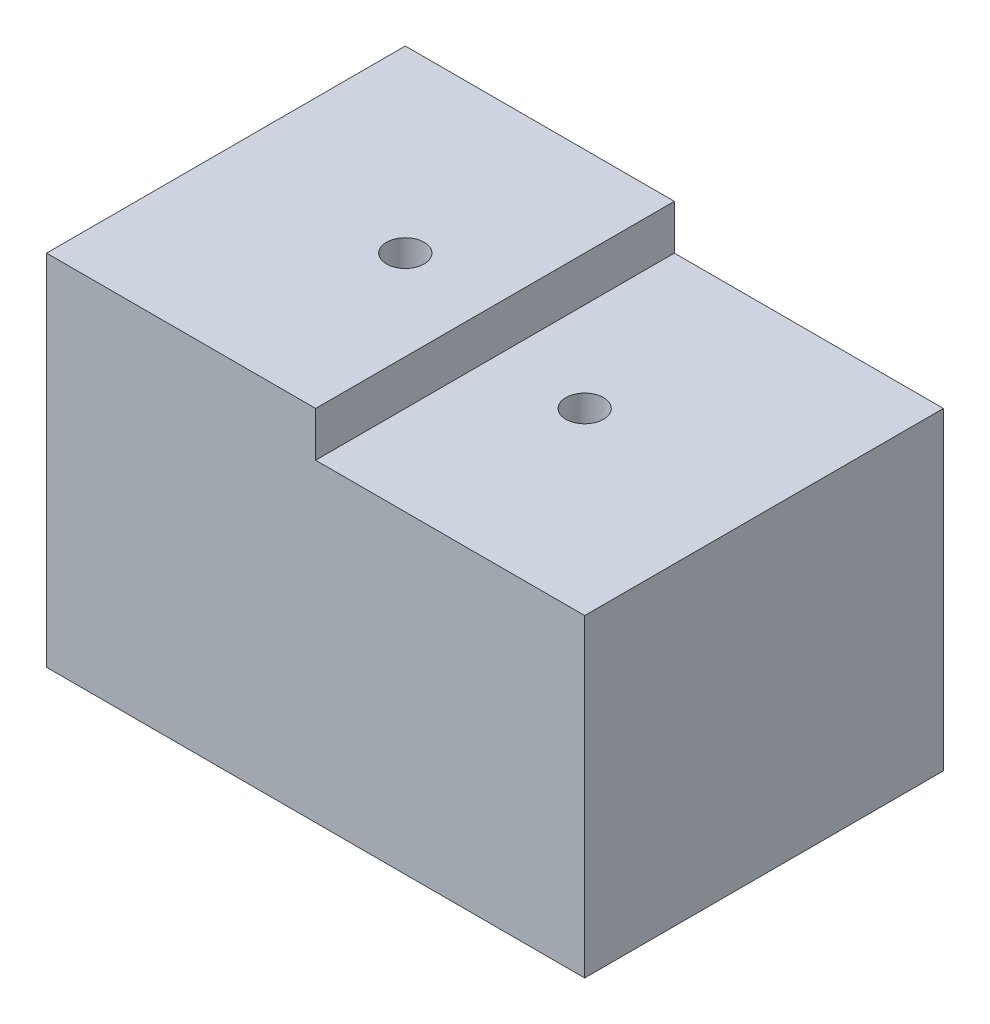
ISO-10303-21;
HEADER;
FILE_DESCRIPTION(('STEP AP214'),'2;1');
FILE_NAME('part.step','',(''),(''),'','','');
FILE_SCHEMA(('AUTOMOTIVE_DESIGN { 1 0 10303 214 1 1 1 1 }'));
ENDSEC;
DATA;
#1=APPLICATION_CONTEXT('core data for automotive mechanical design processes');
#2=APPLICATION_PROTOCOL_DEFINITION('international standard','automotive_design',2000,#1);
#3=PRODUCT_CONTEXT('',#1,'mechanical');
#4=PRODUCT('Part','Part','',(#3));
#5=PRODUCT_RELATED_PRODUCT_CATEGORY('part','',(#4));
#6=PRODUCT_DEFINITION_FORMATION('','',#4);
#7=PRODUCT_DEFINITION_CONTEXT('part definition',#1,'design');
#8=PRODUCT_DEFINITION('design','',#6,#7);
#9=PRODUCT_DEFINITION_SHAPE('','',#8);
#10=(LENGTH_UNIT() NAMED_UNIT(*) SI_UNIT(.MILLI.,.METRE.));
#11=(NAMED_UNIT(*) PLANE_ANGLE_UNIT() SI_UNIT($,.RADIAN.));
#12=(NAMED_UNIT(*) SI_UNIT($,.STERADIAN.) SOLID_ANGLE_UNIT());
#13=UNCERTAINTY_MEASURE_WITH_UNIT(LENGTH_MEASURE(1.E-05),#10,'distance_accuracy_value','');
#14=(GEOMETRIC_REPRESENTATION_CONTEXT(3) GLOBAL_UNCERTAINTY_ASSIGNED_CONTEXT((#13)) GLOBAL_UNIT_ASSIGNED_CONTEXT((#10,
#11,#12)) REPRESENTATION_CONTEXT('',''));
#15=CARTESIAN_POINT('',(0.,0.,0.));
#16=DIRECTION('',(0.,0.,1.));
#17=DIRECTION('',(1.,0.,0.));
#18=AXIS2_PLACEMENT_3D('',#15,#16,#17);
#19=CARTESIAN_POINT('',(60.,40.,0.));
#20=DIRECTION('',(-1.,0.,0.));
#21=DIRECTION('',(0.,0.,1.));
#22=AXIS2_PLACEMENT_3D('',#19,#20,#21);
#23=PLANE('',#22);
#24=DIRECTION('',(0.,0.,-1.));
#25=VECTOR('',#24,1.);
#26=CARTESIAN_POINT('',(60.,35.,-40.));
#27=LINE('',#26,#25);
#28=CARTESIAN_POINT('',(60.,35.,0.));
#29=VERTEX_POINT('',#28);
#30=CARTESIAN_POINT('',(60.,35.,-40.));
#31=VERTEX_POINT('',#30);
#32=EDGE_CURVE('E128',#29,#31,#27,.T.);
#33=ORIENTED_EDGE('',*,*,#32,.F.);
#34=DIRECTION('',(0.,-1.,0.));
#35=VECTOR('',#34,1.);
#36=CARTESIAN_POINT('',(60.,40.,0.));
#37=LINE('',#36,#35);
#38=CARTESIAN_POINT('',(60.,0.,0.));
#39=VERTEX_POINT('',#38);
#40=EDGE_CURVE('E40',#29,#39,#37,.T.);
#41=ORIENTED_EDGE('',*,*,#40,.T.);
#42=DIRECTION('',(0.,0.,-1.));
#43=VECTOR('',#42,1.);
#44=CARTESIAN_POINT('',(60.,0.,0.));
#45=LINE('',#44,#43);
#46=CARTESIAN_POINT('',(60.,0.,-40.));
#47=VERTEX_POINT('',#46);
#48=EDGE_CURVE('E126',#39,#47,#45,.T.);
#49=ORIENTED_EDGE('',*,*,#48,.T.);
#50=DIRECTION('',(0.,-1.,0.));
#51=VECTOR('',#50,1.);
#52=CARTESIAN_POINT('',(60.,40.,-40.));
#53=LINE('',#52,#51);
#54=EDGE_CURVE('E118',#31,#47,#53,.T.);
#55=ORIENTED_EDGE('',*,*,#54,.F.);
#56=EDGE_LOOP('',(#33,#41,#49,#55));
#57=FACE_BOUND('',#56,.T.);
#58=ADVANCED_FACE('F31',(#57),#23,.F.);
#59=CARTESIAN_POINT('',(0.,40.,0.));
#60=DIRECTION('',(1.,0.,0.));
#61=DIRECTION('',(0.,0.,-1.));
#62=AXIS2_PLACEMENT_3D('',#59,#60,#61);
#63=PLANE('',#62);
#64=DIRECTION('',(0.,0.,1.));
#65=VECTOR('',#64,1.);
#66=CARTESIAN_POINT('',(0.,0.,0.));
#67=LINE('',#66,#65);
#68=CARTESIAN_POINT('',(0.,0.,-40.));
#69=VERTEX_POINT('',#68);
#70=CARTESIAN_POINT('',(0.,0.,0.));
#71=VERTEX_POINT('',#70);
#72=EDGE_CURVE('E133',#69,#71,#67,.T.);
#73=ORIENTED_EDGE('',*,*,#72,.T.);
#74=DIRECTION('',(0.,-1.,0.));
#75=VECTOR('',#74,1.);
#76=CARTESIAN_POINT('',(0.,40.,0.));
#77=LINE('',#76,#75);
#78=CARTESIAN_POINT('',(0.,40.,0.));
#79=VERTEX_POINT('',#78);
#80=EDGE_CURVE('E11',#79,#71,#77,.T.);
#81=ORIENTED_EDGE('',*,*,#80,.F.);
#82=DIRECTION('',(0.,0.,1.));
#83=VECTOR('',#82,1.);
#84=CARTESIAN_POINT('',(0.,40.,0.));
#85=LINE('',#84,#83);
#86=CARTESIAN_POINT('',(0.,40.,-40.));
#87=VERTEX_POINT('',#86);
#88=EDGE_CURVE('E107',#87,#79,#85,.T.);
#89=ORIENTED_EDGE('',*,*,#88,.F.);
#90=DIRECTION('',(0.,-1.,0.));
#91=VECTOR('',#90,1.);
#92=CARTESIAN_POINT('',(0.,40.,-40.));
#93=LINE('',#92,#91);
#94=EDGE_CURVE('E110',#87,#69,#93,.T.);
#95=ORIENTED_EDGE('',*,*,#94,.T.);
#96=EDGE_LOOP('',(#73,#81,#89,#95));
#97=FACE_BOUND('',#96,.T.);
#98=ADVANCED_FACE('F33',(#97),#63,.F.);
#99=CARTESIAN_POINT('',(0.,40.,0.));
#100=DIRECTION('',(0.,0.,-1.));
#101=DIRECTION('',(-1.,0.,0.));
#102=AXIS2_PLACEMENT_3D('',#99,#100,#101);
#103=PLANE('',#102);
#104=DIRECTION('',(1.,0.,0.));
#105=VECTOR('',#104,1.);
#106=CARTESIAN_POINT('',(30.,35.,0.));
#107=LINE('',#106,#105);
#108=CARTESIAN_POINT('',(30.,35.,0.));
#109=VERTEX_POINT('',#108);
#110=EDGE_CURVE('E102',#109,#29,#107,.T.);
#111=ORIENTED_EDGE('',*,*,#110,.F.);
#112=DIRECTION('',(0.,1.,0.));
#113=VECTOR('',#112,1.);
#114=CARTESIAN_POINT('',(30.,35.,0.));
#115=LINE('',#114,#113);
#116=CARTESIAN_POINT('',(30.,40.,0.));
#117=VERTEX_POINT('',#116);
#118=EDGE_CURVE('E92',#109,#117,#115,.T.);
#119=ORIENTED_EDGE('',*,*,#118,.T.);
#120=DIRECTION('',(1.,0.,0.));
#121=VECTOR('',#120,1.);
#122=CARTESIAN_POINT('',(0.,40.,0.));
#123=LINE('',#122,#121);
#124=EDGE_CURVE('E100',#79,#117,#123,.T.);
#125=ORIENTED_EDGE('',*,*,#124,.F.);
#126=ORIENTED_EDGE('',*,*,#80,.T.);
#127=DIRECTION('',(1.,0.,0.));
#128=VECTOR('',#127,1.);
#129=CARTESIAN_POINT('',(0.,0.,0.));
#130=LINE('',#129,#128);
#131=EDGE_CURVE('E129',#71,#39,#130,.T.);
#132=ORIENTED_EDGE('',*,*,#131,.T.);
#133=ORIENTED_EDGE('',*,*,#40,.F.);
#134=EDGE_LOOP('',(#111,#119,#125,#126,#132,#133));
#135=FACE_BOUND('',#134,.T.);
#136=ADVANCED_FACE('F99',(#135),#103,.F.);
#137=CARTESIAN_POINT('',(0.,40.,-40.));
#138=DIRECTION('',(0.,0.,1.));
#139=DIRECTION('',(1.,0.,0.));
#140=AXIS2_PLACEMENT_3D('',#137,#138,#139);
#141=PLANE('',#140);
#142=DIRECTION('',(-1.,0.,0.));
#143=VECTOR('',#142,1.);
#144=CARTESIAN_POINT('',(0.,40.,-40.));
#145=LINE('',#144,#143);
#146=CARTESIAN_POINT('',(30.,40.,-40.));
#147=VERTEX_POINT('',#146);
#148=EDGE_CURVE('E54',#147,#87,#145,.T.);
#149=ORIENTED_EDGE('',*,*,#148,.F.);
#150=DIRECTION('',(0.,1.,0.));
#151=VECTOR('',#150,1.);
#152=CARTESIAN_POINT('',(30.,35.,-40.));
#153=LINE('',#152,#151);
#154=CARTESIAN_POINT('',(30.,35.,-40.));
#155=VERTEX_POINT('',#154);
#156=EDGE_CURVE('E47',#155,#147,#153,.T.);
#157=ORIENTED_EDGE('',*,*,#156,.F.);
#158=DIRECTION('',(-1.,0.,0.));
#159=VECTOR('',#158,1.);
#160=CARTESIAN_POINT('',(30.,35.,-40.));
#161=LINE('',#160,#159);
#162=EDGE_CURVE('E103',#31,#155,#161,.T.);
#163=ORIENTED_EDGE('',*,*,#162,.F.);
#164=ORIENTED_EDGE('',*,*,#54,.T.);
#165=DIRECTION('',(-1.,0.,0.));
#166=VECTOR('',#165,1.);
#167=CARTESIAN_POINT('',(0.,0.,-40.));
#168=LINE('',#167,#166);
#169=EDGE_CURVE('E112',#47,#69,#168,.T.);
#170=ORIENTED_EDGE('',*,*,#169,.T.);
#171=ORIENTED_EDGE('',*,*,#94,.F.);
#172=EDGE_LOOP('',(#149,#157,#163,#164,#170,#171));
#173=FACE_BOUND('',#172,.T.);
#174=ADVANCED_FACE('F158',(#173),#141,.F.);
#175=CARTESIAN_POINT('',(0.,40.,-40.));
#176=DIRECTION('',(0.,-1.,0.));
#177=DIRECTION('',(0.,0.,-1.));
#178=AXIS2_PLACEMENT_3D('',#175,#176,#177);
#179=PLANE('',#178);
#180=CARTESIAN_POINT('',(20.,40.,-20.));
#181=DIRECTION('',(0.,1.,0.));
#182=DIRECTION('',(0.,0.,1.));
#183=AXIS2_PLACEMENT_3D('',#180,#181,#182);
#184=CIRCLE('',#183,2.09999999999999);
#185=CARTESIAN_POINT('',(20.,40.,-17.9));
#186=VERTEX_POINT('',#185);
#187=EDGE_CURVE('E142',#186,#186,#184,.T.);
#188=ORIENTED_EDGE('',*,*,#187,.F.);
#189=EDGE_LOOP('',(#188));
#190=FACE_BOUND('',#189,.T.);
#191=ORIENTED_EDGE('',*,*,#124,.T.);
#192=DIRECTION('',(0.,0.,1.));
#193=VECTOR('',#192,1.);
#194=CARTESIAN_POINT('',(30.,40.,-40.));
#195=LINE('',#194,#193);
#196=EDGE_CURVE('E89',#147,#117,#195,.T.);
#197=ORIENTED_EDGE('',*,*,#196,.F.);
#198=ORIENTED_EDGE('',*,*,#148,.T.);
#199=ORIENTED_EDGE('',*,*,#88,.T.);
#200=EDGE_LOOP('',(#191,#197,#198,#199));
#201=FACE_BOUND('',#200,.T.);
#202=ADVANCED_FACE('F105',(#190,#201),#179,.F.);
#203=CARTESIAN_POINT('',(0.,0.,-40.));
#204=DIRECTION('',(0.,-1.,0.));
#205=DIRECTION('',(0.,0.,-1.));
#206=AXIS2_PLACEMENT_3D('',#203,#204,#205);
#207=PLANE('',#206);
#208=ORIENTED_EDGE('',*,*,#72,.F.);
#209=ORIENTED_EDGE('',*,*,#169,.F.);
#210=ORIENTED_EDGE('',*,*,#48,.F.);
#211=ORIENTED_EDGE('',*,*,#131,.F.);
#212=EDGE_LOOP('',(#208,#209,#210,#211));
#213=FACE_BOUND('',#212,.T.);
#214=ADVANCED_FACE('F135',(#213),#207,.T.);
#215=CARTESIAN_POINT('',(20.,40.,-20.));
#216=DIRECTION('',(0.,1.,0.));
#217=DIRECTION('',(0.,0.,1.));
#218=AXIS2_PLACEMENT_3D('',#215,#216,#217);
#219=CYLINDRICAL_SURFACE('',#218,2.09999999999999);
#220=CARTESIAN_POINT('',(20.,20.,-20.));
#221=DIRECTION('',(0.,1.,0.));
#222=DIRECTION('',(0.,0.,1.));
#223=AXIS2_PLACEMENT_3D('',#220,#221,#222);
#224=CIRCLE('',#223,2.09999999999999);
#225=CARTESIAN_POINT('',(20.,20.,-17.9));
#226=VERTEX_POINT('',#225);
#227=EDGE_CURVE('E145',#226,#226,#224,.T.);
#228=ORIENTED_EDGE('',*,*,#227,.F.);
#229=EDGE_LOOP('',(#228));
#230=FACE_BOUND('',#229,.T.);
#231=ORIENTED_EDGE('',*,*,#187,.T.);
#232=EDGE_LOOP('',(#231));
#233=FACE_BOUND('',#232,.T.);
#234=ADVANCED_FACE('F177',(#230,#233),#219,.F.);
#235=CARTESIAN_POINT('',(20.,20.,-20.));
#236=DIRECTION('',(0.,1.,0.));
#237=DIRECTION('',(0.,0.,1.));
#238=AXIS2_PLACEMENT_3D('',#235,#236,#237);
#239=CONICAL_SURFACE('',#238,2.09999999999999,1.02974425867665);
#240=CARTESIAN_POINT('',(20.,18.7381927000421,-20.));
#241=VERTEX_POINT('',#240);
#242=VERTEX_LOOP('',#241);
#243=FACE_BOUND('',#242,.T.);
#244=ORIENTED_EDGE('',*,*,#227,.T.);
#245=EDGE_LOOP('',(#244));
#246=FACE_BOUND('',#245,.T.);
#247=ADVANCED_FACE('F188',(#243,#246),#239,.F.);
#248=CARTESIAN_POINT('',(30.,35.,0.));
#249=DIRECTION('',(0.,1.,0.));
#250=DIRECTION('',(0.,0.,1.));
#251=AXIS2_PLACEMENT_3D('',#248,#249,#250);
#252=PLANE('',#251);
#253=DIRECTION('',(0.,0.,1.));
#254=VECTOR('',#253,1.);
#255=CARTESIAN_POINT('',(30.,35.,-40.));
#256=LINE('',#255,#254);
#257=EDGE_CURVE('E95',#155,#109,#256,.T.);
#258=ORIENTED_EDGE('',*,*,#257,.T.);
#259=ORIENTED_EDGE('',*,*,#110,.T.);
#260=ORIENTED_EDGE('',*,*,#32,.T.);
#261=ORIENTED_EDGE('',*,*,#162,.T.);
#262=EDGE_LOOP('',(#258,#259,#260,#261));
#263=FACE_BOUND('',#262,.T.);
#264=CARTESIAN_POINT('',(40.,35.,-20.));
#265=DIRECTION('',(0.,1.,0.));
#266=DIRECTION('',(0.,0.,1.));
#267=AXIS2_PLACEMENT_3D('',#264,#265,#266);
#268=CIRCLE('',#267,2.09999999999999);
#269=CARTESIAN_POINT('',(40.,35.,-17.9));
#270=VERTEX_POINT('',#269);
#271=EDGE_CURVE('E35',#270,#270,#268,.F.);
#272=ORIENTED_EDGE('',*,*,#271,.T.);
#273=EDGE_LOOP('',(#272));
#274=FACE_BOUND('',#273,.T.);
#275=ADVANCED_FACE('F154',(#263,#274),#252,.T.);
#276=CARTESIAN_POINT('',(30.,35.,-40.));
#277=DIRECTION('',(-1.,0.,0.));
#278=DIRECTION('',(0.,0.,1.));
#279=AXIS2_PLACEMENT_3D('',#276,#277,#278);
#280=PLANE('',#279);
#281=ORIENTED_EDGE('',*,*,#196,.T.);
#282=ORIENTED_EDGE('',*,*,#118,.F.);
#283=ORIENTED_EDGE('',*,*,#257,.F.);
#284=ORIENTED_EDGE('',*,*,#156,.T.);
#285=EDGE_LOOP('',(#281,#282,#283,#284));
#286=FACE_BOUND('',#285,.T.);
#287=ADVANCED_FACE('F91',(#286),#280,.F.);
#288=CARTESIAN_POINT('',(40.,20.,-20.));
#289=DIRECTION('',(0.,1.,0.));
#290=DIRECTION('',(0.,0.,1.));
#291=AXIS2_PLACEMENT_3D('',#288,#289,#290);
#292=CONICAL_SURFACE('',#291,2.1,1.02974425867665);
#293=CARTESIAN_POINT('',(40.,18.7381927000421,-20.));
#294=VERTEX_POINT('',#293);
#295=VERTEX_LOOP('',#294);
#296=FACE_BOUND('',#295,.T.);
#297=CARTESIAN_POINT('',(40.,20.,-20.));
#298=DIRECTION('',(0.,1.,0.));
#299=DIRECTION('',(0.,0.,1.));
#300=AXIS2_PLACEMENT_3D('',#297,#298,#299);
#301=CIRCLE('',#300,2.1);
#302=CARTESIAN_POINT('',(40.,20.,-17.9));
#303=VERTEX_POINT('',#302);
#304=EDGE_CURVE('E139',#303,#303,#301,.T.);
#305=ORIENTED_EDGE('',*,*,#304,.T.);
#306=EDGE_LOOP('',(#305));
#307=FACE_BOUND('',#306,.T.);
#308=ADVANCED_FACE('F181',(#296,#307),#292,.F.);
#309=CARTESIAN_POINT('',(40.,40.,-20.));
#310=DIRECTION('',(0.,1.,0.));
#311=DIRECTION('',(0.,0.,1.));
#312=AXIS2_PLACEMENT_3D('',#309,#310,#311);
#313=CYLINDRICAL_SURFACE('',#312,2.09999999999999);
#314=ORIENTED_EDGE('',*,*,#304,.F.);
#315=EDGE_LOOP('',(#314));
#316=FACE_BOUND('',#315,.T.);
#317=ORIENTED_EDGE('',*,*,#271,.F.);
#318=EDGE_LOOP('',(#317));
#319=FACE_BOUND('',#318,.T.);
#320=ADVANCED_FACE('F178',(#316,#319),#313,.F.);
#321=CLOSED_SHELL('',(#58,#98,#136,#174,#202,#214,#234,#247,#275,#287,#308,#320));
#322=MANIFOLD_SOLID_BREP('B2',#321);
#323=ADVANCED_BREP_SHAPE_REPRESENTATION('',(#18,#322),#14);
#324=SHAPE_DEFINITION_REPRESENTATION(#9,#323);
ENDSEC;
END-ISO-10303-21;
